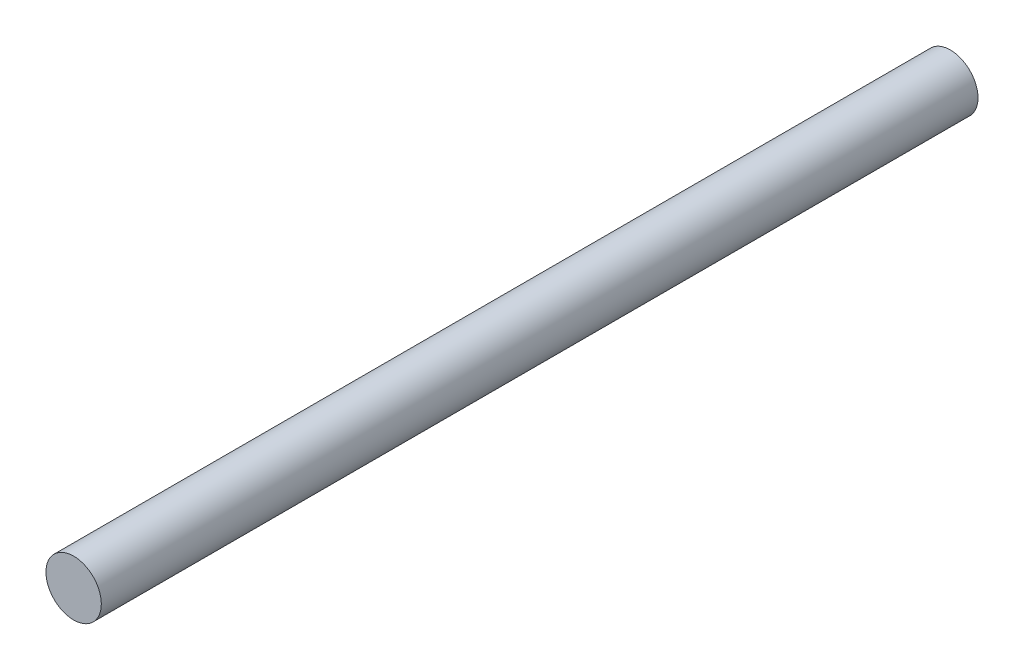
from build123d import *

# Parameters (mm, degrees)
SKETCH1_R           = 30
BOSS_EXTRUDE1_DEPTH = 950


with BuildPart() as part:
    # Sketch1 → Boss-Extrude1 (new body)
    with BuildSketch(Plane.XY):
        Circle(SKETCH1_R)
    extrude(amount=-BOSS_EXTRUDE1_DEPTH)


solid = part.part
